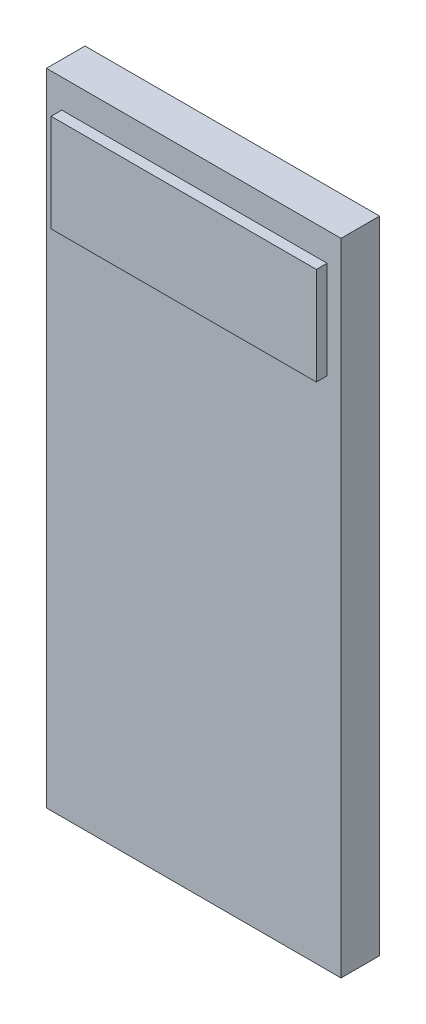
from build123d import *

# Parameters (mm, degrees)
ESQUISSE1_W      = 13.75
ESQUISSE1_H      = 29.9
EXTRUSION1_DEPTH = 1.8
ESQUISSE3_W      = 12.383229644
ESQUISSE3_H      = 4.551293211
EXTRUSION2_DEPTH = 0.5


with BuildPart() as part:
    # Esquisse1 → Extrusion1 (new body)
    with BuildSketch(Plane.XY):
        with Locations((-0.025, 31.8)):
            Rectangle(ESQUISSE1_W, ESQUISSE1_H)
    extrude(amount=EXTRUSION1_DEPTH)

    # Esquisse3 → Extrusion2 (add)
    with BuildSketch(Plane.XY.offset(1.8)):
        with Locations((0.007916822, 43.142287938)):
            Rectangle(ESQUISSE3_W, ESQUISSE3_H)
    extrude(amount=EXTRUSION2_DEPTH)


solid = part.part
